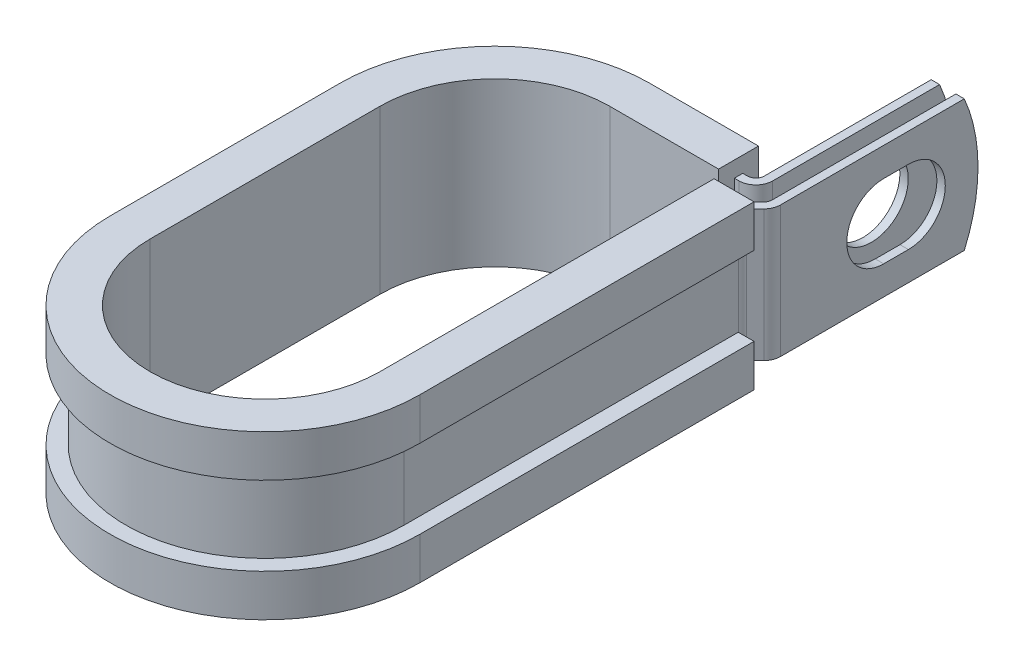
from build123d import *

# Parameters (mm, degrees)
EXTRUDE_THIN1_DEPTH = 6.35
SKETCH2_R           = 3.5687
CUT_EXTRUDE1_DEPTH  = 0.8128
CUT_EXTRUDE2_DEPTH  = 0.8128
CUT_EXTRUDE3_DEPTH  = 45.158394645


with BuildPart() as part:
    # Sketch1 → Extrude-Thin1 (new, symmetric)
    with BuildSketch(Plane(origin=(0, 0, 0), x_dir=(1, 0, 0), z_dir=(0, 1, 0))):
        with BuildLine():
            Line((14.176874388, 31.7246), (14.176874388, 12.6365))
            ThreePointArc((14.176874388, 12.6365), (14.115003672, 12.325454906), (13.93881078, 12.061763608))
            Line((13.93881078, 12.061763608), (13.112627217, 11.235580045))
            ThreePointArc((13.112627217, 11.235580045), (12.760241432, 10.708197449), (12.6365, 10.086107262))
            Line((12.6365, 10.086107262), (12.6365, 0))
            Line((12.6365, 0), (12.6365, -22.225))
            ThreePointArc((12.6365, -22.225), (0, -34.8615), (-12.6365, -22.225))
            Line((-12.6365, -22.225), (-12.6365, 0))
            ThreePointArc((-12.6365, 0), (-8.93535484, 8.93535484), (0, 12.6365))
            Line((0, 12.6365), (10.976474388, 12.6365))
            ThreePointArc((10.976474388, 12.6365), (12.125947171, 13.112627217), (12.602074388, 14.2621))
            Line((12.602074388, 14.2621), (12.602074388, 31.7246))
            Line((12.602074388, 31.7246), (11.789274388, 31.7246))
            Line((11.789274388, 31.7246), (11.789274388, 14.2621))
            ThreePointArc((11.789274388, 14.2621), (11.55121078, 13.687363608), (10.976474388, 13.4493))
            Line((10.976474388, 13.4493), (0, 13.4493))
            ThreePointArc((0, 13.4493), (-9.510091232, 9.510091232), (-13.4493, 0))
            Line((-13.4493, 0), (-13.4493, -22.225))
            ThreePointArc((-13.4493, -22.225), (0, -35.6743), (13.4493, -22.225))
            Line((13.4493, -22.225), (13.4493, 0))
            Line((13.4493, 0), (13.4493, 10.086107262))
            ThreePointArc((13.4493, 10.086107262), (13.511170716, 10.397152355), (13.687363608, 10.660843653))
            Line((13.687363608, 10.660843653), (14.513547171, 11.487027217))
            ThreePointArc((14.513547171, 11.487027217), (14.865932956, 12.014409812), (14.989674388, 12.6365))
            Line((14.989674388, 12.6365), (14.989674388, 31.7246))
            Line((14.989674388, 31.7246), (14.176874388, 31.7246))
        make_face()
    extrude(amount=EXTRUDE_THIN1_DEPTH, both=True)

    # Sketch2 → Cut-Extrude1 (cut)
    with BuildSketch(Plane.ZY.offset(-11.789274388)):
        with Locations((-23.7998, 0)):
            Circle(SKETCH2_R)
    extrude(amount=-CUT_EXTRUDE1_DEPTH, mode=Mode.SUBTRACT)

    # Sketch3 → Cut-Extrude2 (cut)
    with BuildSketch(Plane(origin=(14.989674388, 0, 0), x_dir=(0, 0, -1), z_dir=(1, 0, 0))):
        with BuildLine():
            Line((22.606, 3.5687), (24.9936, 3.5687))
            ThreePointArc((24.9936, 3.5687), (28.5623, 0), (24.9936, -3.5687))
            Line((24.9936, -3.5687), (22.606, -3.5687))
            ThreePointArc((22.606, -3.5687), (19.0373, 0), (22.606, 3.5687))
        make_face()
    extrude(amount=-CUT_EXTRUDE2_DEPTH, mode=Mode.SUBTRACT)

    # Sketch4 → Cut-Extrude3 (cut, through all)
    with BuildSketch(Plane.ZY.offset(-11.789274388)):
        with BuildLine():
            Line((-30.399277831, 6.35), (-31.7246, 6.35))
            Line((-31.7246, 6.35), (-31.7246, 0))
            ThreePointArc((-31.7246, 0), (-31.389737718, 3.243415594), (-30.399277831, 6.35))
        make_face()
        with BuildLine():
            ThreePointArc((-30.399277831, -6.35), (-31.389737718, -3.243415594), (-31.7246, 0))
            Line((-31.7246, 0), (-31.7246, -6.35))
            Line((-31.7246, -6.35), (-30.399277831, -6.35))
        make_face()
    extrude(amount=-CUT_EXTRUDE3_DEPTH, mode=Mode.SUBTRACT)

    # Sweep1: sweep along a path in Sketch6
    with BuildLine(Plane(origin=(0, 6.35, 0), x_dir=(1, 0, 0), z_dir=(0, 1, 0))) as sweep1_path:
        Line((11.1125, 10.086107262), (11.1125, 0))
        Line((11.1125, 0), (11.1125, -22.225))
        ThreePointArc((11.1125, -22.225), (0, -33.3375), (-11.1125, -22.225))
        Line((-11.1125, -22.225), (-11.1125, 0))
        ThreePointArc((-11.1125, 0), (-7.857724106, 7.857724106), (0, 11.1125))
        Line((0, 11.1125), (10.519274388, 11.1125))
    # Sketch5 → Sweep1 (sweep)
    with BuildSketch(Plane(origin=(0, 0, -10.086107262), x_dir=(-1, 0, 0), z_dir=(0, 0, -1))):
        Polygon((-13.4493, 6.35), (-12.6365, 6.35), (-12.6365, -6.35), (-13.4493, -6.35), (-13.4493, -3.81), (-14.9733, -3.81), (-14.9733, -7.874), (-11.1125, -7.874), (-11.1125, 7.874), (-14.9733, 7.874), (-14.9733, 3.81), (-13.4493, 3.81), align=None)
    sweep(path=sweep1_path.line)


solid = part.part
